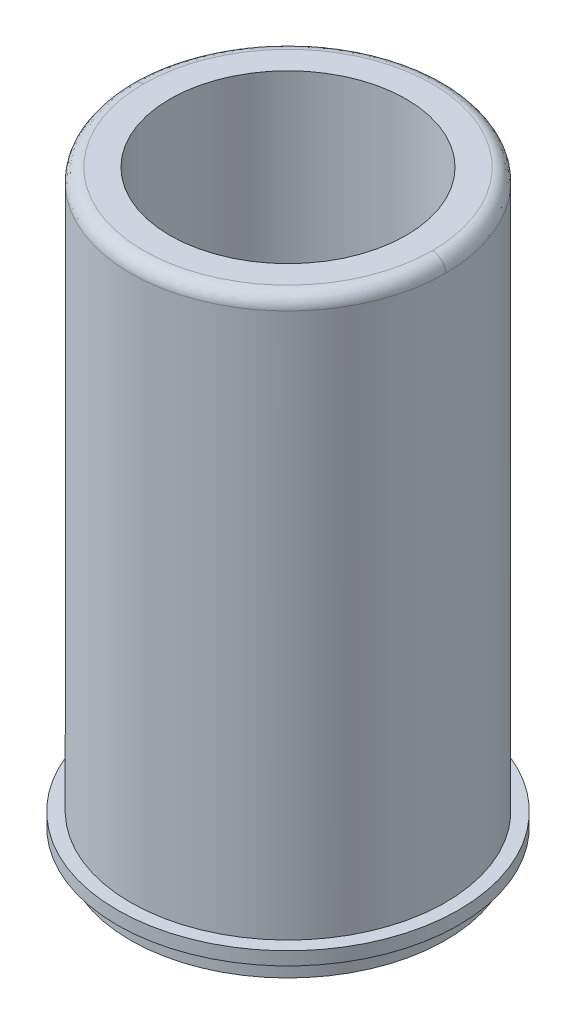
ISO-10303-21;
HEADER;
FILE_DESCRIPTION(('STEP AP214'),'2;1');
FILE_NAME('part.step','',(''),(''),'','','');
FILE_SCHEMA(('AUTOMOTIVE_DESIGN { 1 0 10303 214 1 1 1 1 }'));
ENDSEC;
DATA;
#1=APPLICATION_CONTEXT('core data for automotive mechanical design processes');
#2=APPLICATION_PROTOCOL_DEFINITION('international standard','automotive_design',2000,#1);
#3=PRODUCT_CONTEXT('',#1,'mechanical');
#4=PRODUCT('Part','Part','',(#3));
#5=PRODUCT_RELATED_PRODUCT_CATEGORY('part','',(#4));
#6=PRODUCT_DEFINITION_FORMATION('','',#4);
#7=PRODUCT_DEFINITION_CONTEXT('part definition',#1,'design');
#8=PRODUCT_DEFINITION('design','',#6,#7);
#9=PRODUCT_DEFINITION_SHAPE('','',#8);
#10=(LENGTH_UNIT() NAMED_UNIT(*) SI_UNIT(.MILLI.,.METRE.));
#11=(NAMED_UNIT(*) PLANE_ANGLE_UNIT() SI_UNIT($,.RADIAN.));
#12=(NAMED_UNIT(*) SI_UNIT($,.STERADIAN.) SOLID_ANGLE_UNIT());
#13=UNCERTAINTY_MEASURE_WITH_UNIT(LENGTH_MEASURE(1.E-05),#10,'distance_accuracy_value','');
#14=(GEOMETRIC_REPRESENTATION_CONTEXT(3) GLOBAL_UNCERTAINTY_ASSIGNED_CONTEXT((#13)) GLOBAL_UNIT_ASSIGNED_CONTEXT((#10,
#11,#12)) REPRESENTATION_CONTEXT('',''));
#15=CARTESIAN_POINT('',(0.,0.,0.));
#16=DIRECTION('',(0.,0.,1.));
#17=DIRECTION('',(1.,0.,0.));
#18=AXIS2_PLACEMENT_3D('',#15,#16,#17);
#19=CARTESIAN_POINT('',(-58.156,-130.,158.844));
#20=DIRECTION('',(0.,-1.,0.));
#21=DIRECTION('',(1.,0.,0.));
#22=AXIS2_PLACEMENT_3D('',#19,#20,#21);
#23=PLANE('',#22);
#24=CARTESIAN_POINT('',(-45.,-130.,172.));
#25=DIRECTION('',(0.,1.,0.));
#26=DIRECTION('',(0.,0.,1.));
#27=AXIS2_PLACEMENT_3D('',#24,#25,#26);
#28=CIRCLE('',#27,12.);
#29=CARTESIAN_POINT('',(-45.,-130.,184.));
#30=VERTEX_POINT('',#29);
#31=EDGE_CURVE('E29',#30,#30,#28,.T.);
#32=ORIENTED_EDGE('',*,*,#31,.T.);
#33=EDGE_LOOP('',(#32));
#34=FACE_BOUND('',#33,.T.);
#35=CARTESIAN_POINT('',(-45.,-130.,172.));
#36=DIRECTION('',(0.,-1.,0.));
#37=DIRECTION('',(0.,0.,-1.));
#38=AXIS2_PLACEMENT_3D('',#35,#36,#37);
#39=CIRCLE('',#38,13.);
#40=CARTESIAN_POINT('',(-45.,-130.,159.));
#41=VERTEX_POINT('',#40);
#42=EDGE_CURVE('E112',#41,#41,#39,.T.);
#43=ORIENTED_EDGE('',*,*,#42,.T.);
#44=EDGE_LOOP('',(#43));
#45=FACE_BOUND('',#44,.T.);
#46=ADVANCED_FACE('F24',(#34,#45),#23,.T.);
#47=CARTESIAN_POINT('',(-45.,-131.5,172.));
#48=DIRECTION('',(0.,1.,0.));
#49=DIRECTION('',(0.,0.,1.));
#50=AXIS2_PLACEMENT_3D('',#47,#48,#49);
#51=CYLINDRICAL_SURFACE('',#50,12.);
#52=ORIENTED_EDGE('',*,*,#31,.F.);
#53=EDGE_LOOP('',(#52));
#54=FACE_BOUND('',#53,.T.);
#55=CARTESIAN_POINT('',(-45.,-131.5,172.));
#56=DIRECTION('',(0.,1.,0.));
#57=DIRECTION('',(0.,0.,1.));
#58=AXIS2_PLACEMENT_3D('',#55,#56,#57);
#59=CIRCLE('',#58,12.);
#60=CARTESIAN_POINT('',(-45.,-131.5,184.));
#61=VERTEX_POINT('',#60);
#62=EDGE_CURVE('E69',#61,#61,#59,.F.);
#63=ORIENTED_EDGE('',*,*,#62,.F.);
#64=EDGE_LOOP('',(#63));
#65=FACE_BOUND('',#64,.T.);
#66=ADVANCED_FACE('F120',(#54,#65),#51,.T.);
#67=CARTESIAN_POINT('',(-45.,-129.,172.));
#68=DIRECTION('',(0.,-1.,0.));
#69=DIRECTION('',(0.,0.,-1.));
#70=AXIS2_PLACEMENT_3D('',#67,#68,#69);
#71=CYLINDRICAL_SURFACE('',#70,13.);
#72=ORIENTED_EDGE('',*,*,#42,.F.);
#73=EDGE_LOOP('',(#72));
#74=FACE_BOUND('',#73,.T.);
#75=CARTESIAN_POINT('',(-45.,-129.,172.));
#76=DIRECTION('',(0.,-1.,0.));
#77=DIRECTION('',(0.,0.,-1.));
#78=AXIS2_PLACEMENT_3D('',#75,#76,#77);
#79=CIRCLE('',#78,13.);
#80=CARTESIAN_POINT('',(-45.,-129.,159.));
#81=VERTEX_POINT('',#80);
#82=EDGE_CURVE('E66',#81,#81,#79,.F.);
#83=ORIENTED_EDGE('',*,*,#82,.F.);
#84=EDGE_LOOP('',(#83));
#85=FACE_BOUND('',#84,.T.);
#86=ADVANCED_FACE('F123',(#74,#85),#71,.T.);
#87=CARTESIAN_POINT('',(-57.144,-131.5,159.856));
#88=DIRECTION('',(0.,-1.,0.));
#89=DIRECTION('',(1.,0.,0.));
#90=AXIS2_PLACEMENT_3D('',#87,#88,#89);
#91=PLANE('',#90);
#92=CARTESIAN_POINT('',(-45.,-131.5,172.));
#93=DIRECTION('',(0.,-1.,0.));
#94=DIRECTION('',(0.,0.,-1.));
#95=AXIS2_PLACEMENT_3D('',#92,#93,#94);
#96=CIRCLE('',#95,9.);
#97=CARTESIAN_POINT('',(-45.,-131.5,163.));
#98=VERTEX_POINT('',#97);
#99=EDGE_CURVE('E108',#98,#98,#96,.T.);
#100=ORIENTED_EDGE('',*,*,#99,.F.);
#101=EDGE_LOOP('',(#100));
#102=FACE_BOUND('',#101,.T.);
#103=ORIENTED_EDGE('',*,*,#62,.T.);
#104=EDGE_LOOP('',(#103));
#105=FACE_BOUND('',#104,.T.);
#106=ADVANCED_FACE('F127',(#102,#105),#91,.T.);
#107=CARTESIAN_POINT('',(-58.156,-129.,185.156));
#108=DIRECTION('',(0.,1.,0.));
#109=DIRECTION('',(1.,0.,0.));
#110=AXIS2_PLACEMENT_3D('',#107,#108,#109);
#111=PLANE('',#110);
#112=CARTESIAN_POINT('',(-45.,-129.,172.));
#113=DIRECTION('',(0.,1.,0.));
#114=DIRECTION('',(0.,0.,1.));
#115=AXIS2_PLACEMENT_3D('',#112,#113,#114);
#116=CIRCLE('',#115,12.);
#117=CARTESIAN_POINT('',(-45.,-129.,184.));
#118=VERTEX_POINT('',#117);
#119=EDGE_CURVE('E105',#118,#118,#116,.F.);
#120=ORIENTED_EDGE('',*,*,#119,.T.);
#121=EDGE_LOOP('',(#120));
#122=FACE_BOUND('',#121,.T.);
#123=ORIENTED_EDGE('',*,*,#82,.T.);
#124=EDGE_LOOP('',(#123));
#125=FACE_BOUND('',#124,.T.);
#126=ADVANCED_FACE('F129',(#122,#125),#111,.T.);
#127=CARTESIAN_POINT('',(-55.900166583,-86.504995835,172.));
#128=CARTESIAN_POINT('',(-55.900166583,-86.504995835,193.800333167));
#129=CARTESIAN_POINT('',(-34.099833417,-86.504995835,193.800333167));
#130=CARTESIAN_POINT('',(-34.099833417,-86.504995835,172.));
#131=CARTESIAN_POINT('',(-56.580053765,-86.436779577,172.));
#132=CARTESIAN_POINT('',(-56.580053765,-86.436779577,195.16010753));
#133=CARTESIAN_POINT('',(-33.419946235,-86.436779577,195.16010753));
#134=CARTESIAN_POINT('',(-33.419946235,-86.436779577,172.));
#135=CARTESIAN_POINT('',(-57.063220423,-86.919946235,172.));
#136=CARTESIAN_POINT('',(-57.063220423,-86.919946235,196.126440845));
#137=CARTESIAN_POINT('',(-32.936779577,-86.919946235,196.126440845));
#138=CARTESIAN_POINT('',(-32.936779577,-86.919946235,172.));
#139=CARTESIAN_POINT('',(-56.995004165,-87.599833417,172.));
#140=CARTESIAN_POINT('',(-56.995004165,-87.599833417,195.990008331));
#141=CARTESIAN_POINT('',(-33.004995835,-87.599833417,195.990008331));
#142=CARTESIAN_POINT('',(-33.004995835,-87.599833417,172.));
#143=(BOUNDED_SURFACE() B_SPLINE_SURFACE(3,3,((#127,#128,#129,#130),(#131,#132,#133,#134),(#135,
#136,#137,#138),(#139,#140,#141,#142)),.UNSPECIFIED.,.F.,.F.,
.F.) B_SPLINE_SURFACE_WITH_KNOTS((4,4),(4,4),(0.,1.),(0.,1.),
.UNSPECIFIED.) GEOMETRIC_REPRESENTATION_ITEM() RATIONAL_B_SPLINE_SURFACE(((1.,0.333333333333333,
0.333333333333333,1.),(0.755320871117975,0.251773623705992,0.251773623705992,0.755320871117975),
(0.755320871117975,0.251773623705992,0.251773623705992,0.755320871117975),(1.,0.333333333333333,
0.333333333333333,1.))) REPRESENTATION_ITEM('') SURFACE());
#144=CARTESIAN_POINT('',(-34.099833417,-86.504995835,172.));
#145=CARTESIAN_POINT('',(-33.419946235,-86.436779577,172.));
#146=CARTESIAN_POINT('',(-32.936779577,-86.919946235,172.));
#147=CARTESIAN_POINT('',(-33.004995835,-87.599833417,172.));
#148=(BOUNDED_CURVE() B_SPLINE_CURVE(3,(#144,#145,#146,#147),.UNSPECIFIED.,.F.,
.F.) B_SPLINE_CURVE_WITH_KNOTS((4,4),(0.,1.),
.UNSPECIFIED.) CURVE() GEOMETRIC_REPRESENTATION_ITEM() RATIONAL_B_SPLINE_CURVE((1.,
0.755320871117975,0.755320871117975,1.)) REPRESENTATION_ITEM(''));
#149=CARTESIAN_POINT('',(-33.0000000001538,-87.4999999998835,172.));
#150=VERTEX_POINT('',#149);
#151=CARTESIAN_POINT('',(-34.0000000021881,-86.500000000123,172.));
#152=VERTEX_POINT('',#151);
#153=EDGE_CURVE('E42',#150,#152,#148,.F.);
#154=CARTESIAN_POINT('',(-34.0000000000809,-86.5000000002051,172.));
#155=CARTESIAN_POINT('',(-34.0000000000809,-86.500000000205,194.000000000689));
#156=CARTESIAN_POINT('',(-55.9999999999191,-86.500000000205,194.000000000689));
#157=CARTESIAN_POINT('',(-55.9999999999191,-86.5000000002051,172.));
#158=(BOUNDED_CURVE() B_SPLINE_CURVE(3,(#154,#155,#156,#157),.UNSPECIFIED.,.F.,
.F.) B_SPLINE_CURVE_WITH_KNOTS((4,4),(0.,1.),
.UNSPECIFIED.) CURVE() GEOMETRIC_REPRESENTATION_ITEM() RATIONAL_B_SPLINE_CURVE((0.956578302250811,
0.318859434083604,0.318859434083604,0.956578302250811)) REPRESENTATION_ITEM(''));
#159=CARTESIAN_POINT('',(-55.9999999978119,-86.500000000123,172.));
#160=VERTEX_POINT('',#159);
#161=EDGE_CURVE('E63',#160,#152,#158,.F.);
#162=CARTESIAN_POINT('',(-55.900166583,-86.504995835,172.));
#163=CARTESIAN_POINT('',(-56.580053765,-86.436779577,172.));
#164=CARTESIAN_POINT('',(-57.063220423,-86.919946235,172.));
#165=CARTESIAN_POINT('',(-56.995004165,-87.599833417,172.));
#166=(BOUNDED_CURVE() B_SPLINE_CURVE(3,(#162,#163,#164,#165),.UNSPECIFIED.,.F.,
.F.) B_SPLINE_CURVE_WITH_KNOTS((4,4),(0.,1.),
.UNSPECIFIED.) CURVE() GEOMETRIC_REPRESENTATION_ITEM() RATIONAL_B_SPLINE_CURVE((1.,
0.755320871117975,0.755320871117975,1.)) REPRESENTATION_ITEM(''));
#167=CARTESIAN_POINT('',(-56.9999999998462,-87.4999999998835,172.000000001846));
#168=VERTEX_POINT('',#167);
#169=EDGE_CURVE('E56',#160,#168,#166,.T.);
#170=CARTESIAN_POINT('',(-45.,-87.4999999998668,172.));
#171=DIRECTION('',(0.,1.,0.));
#172=DIRECTION('',(0.,0.,1.));
#173=AXIS2_PLACEMENT_3D('',#170,#171,#172);
#174=CIRCLE('',#173,11.9999999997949);
#175=EDGE_CURVE('E51',#168,#150,#174,.T.);
#176=ORIENTED_EDGE('',*,*,#153,.T.);
#177=ORIENTED_EDGE('',*,*,#161,.F.);
#178=ORIENTED_EDGE('',*,*,#169,.T.);
#179=ORIENTED_EDGE('',*,*,#175,.T.);
#180=EDGE_LOOP('',(#176,#177,#178,#179));
#181=FACE_BOUND('',#180,.T.);
#182=ADVANCED_FACE('F62',(#181),#143,.T.);
#183=CARTESIAN_POINT('',(-45.,-86.5,172.));
#184=DIRECTION('',(0.,-1.,0.));
#185=DIRECTION('',(0.,0.,-1.));
#186=AXIS2_PLACEMENT_3D('',#183,#184,#185);
#187=CYLINDRICAL_SURFACE('',#186,9.);
#188=ORIENTED_EDGE('',*,*,#99,.T.);
#189=EDGE_LOOP('',(#188));
#190=FACE_BOUND('',#189,.T.);
#191=CARTESIAN_POINT('',(-45.,-86.5,172.));
#192=DIRECTION('',(0.,-1.,0.));
#193=DIRECTION('',(0.,0.,-1.));
#194=AXIS2_PLACEMENT_3D('',#191,#192,#193);
#195=CIRCLE('',#194,9.);
#196=CARTESIAN_POINT('',(-45.,-86.5,163.));
#197=VERTEX_POINT('',#196);
#198=EDGE_CURVE('E60',#197,#197,#195,.T.);
#199=ORIENTED_EDGE('',*,*,#198,.F.);
#200=EDGE_LOOP('',(#199));
#201=FACE_BOUND('',#200,.T.);
#202=ADVANCED_FACE('F180',(#190,#201),#187,.F.);
#203=CARTESIAN_POINT('',(-45.,-129.,172.));
#204=DIRECTION('',(0.,1.,0.));
#205=DIRECTION('',(0.,0.,1.));
#206=AXIS2_PLACEMENT_3D('',#203,#204,#205);
#207=CYLINDRICAL_SURFACE('',#206,12.);
#208=CARTESIAN_POINT('',(-45.,-87.4999999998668,172.));
#209=DIRECTION('',(0.,1.,0.));
#210=DIRECTION('',(0.,0.,1.));
#211=AXIS2_PLACEMENT_3D('',#208,#209,#210);
#212=CIRCLE('',#211,11.9999999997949);
#213=EDGE_CURVE('E35',#150,#168,#212,.T.);
#214=ORIENTED_EDGE('',*,*,#213,.F.);
#215=ORIENTED_EDGE('',*,*,#175,.F.);
#216=EDGE_LOOP('',(#214,#215));
#217=FACE_BOUND('',#216,.T.);
#218=ORIENTED_EDGE('',*,*,#119,.F.);
#219=EDGE_LOOP('',(#218));
#220=FACE_BOUND('',#219,.T.);
#221=ADVANCED_FACE('F53',(#217,#220),#207,.T.);
#222=CARTESIAN_POINT('',(-33.868,-86.5,160.868));
#223=DIRECTION('',(0.,1.,0.));
#224=DIRECTION('',(-1.,0.,0.));
#225=AXIS2_PLACEMENT_3D('',#222,#223,#224);
#226=PLANE('',#225);
#227=ORIENTED_EDGE('',*,*,#198,.T.);
#228=EDGE_LOOP('',(#227));
#229=FACE_BOUND('',#228,.T.);
#230=ORIENTED_EDGE('',*,*,#161,.T.);
#231=CARTESIAN_POINT('',(-55.9999999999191,-86.5000000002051,172.));
#232=CARTESIAN_POINT('',(-55.9999999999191,-86.5000000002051,149.999999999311));
#233=CARTESIAN_POINT('',(-34.0000000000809,-86.5000000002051,149.999999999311));
#234=CARTESIAN_POINT('',(-34.0000000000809,-86.5000000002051,172.));
#235=(BOUNDED_CURVE() B_SPLINE_CURVE(3,(#231,#232,#233,#234),.UNSPECIFIED.,.F.,
.F.) B_SPLINE_CURVE_WITH_KNOTS((4,4),(0.,1.),
.UNSPECIFIED.) CURVE() GEOMETRIC_REPRESENTATION_ITEM() RATIONAL_B_SPLINE_CURVE((0.956578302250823,
0.318859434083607,0.318859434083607,0.956578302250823)) REPRESENTATION_ITEM(''));
#236=EDGE_CURVE('E13',#160,#152,#235,.T.);
#237=ORIENTED_EDGE('',*,*,#236,.F.);
#238=EDGE_LOOP('',(#230,#237));
#239=FACE_BOUND('',#238,.T.);
#240=ADVANCED_FACE('F26',(#229,#239),#226,.T.);
#241=CARTESIAN_POINT('',(-34.099833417,-86.504995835,172.));
#242=CARTESIAN_POINT('',(-34.099833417,-86.504995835,150.199666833));
#243=CARTESIAN_POINT('',(-55.900166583,-86.504995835,150.199666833));
#244=CARTESIAN_POINT('',(-55.900166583,-86.504995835,172.));
#245=CARTESIAN_POINT('',(-33.419946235,-86.436779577,172.));
#246=CARTESIAN_POINT('',(-33.419946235,-86.436779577,148.83989247));
#247=CARTESIAN_POINT('',(-56.580053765,-86.436779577,148.83989247));
#248=CARTESIAN_POINT('',(-56.580053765,-86.436779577,172.));
#249=CARTESIAN_POINT('',(-32.936779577,-86.919946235,172.));
#250=CARTESIAN_POINT('',(-32.936779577,-86.919946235,147.873559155));
#251=CARTESIAN_POINT('',(-57.063220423,-86.919946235,147.873559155));
#252=CARTESIAN_POINT('',(-57.063220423,-86.919946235,172.));
#253=CARTESIAN_POINT('',(-33.004995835,-87.599833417,172.));
#254=CARTESIAN_POINT('',(-33.004995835,-87.599833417,148.009991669));
#255=CARTESIAN_POINT('',(-56.995004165,-87.599833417,148.009991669));
#256=CARTESIAN_POINT('',(-56.995004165,-87.599833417,172.));
#257=(BOUNDED_SURFACE() B_SPLINE_SURFACE(3,3,((#241,#242,#243,#244),(#245,#246,#247,#248),(#249,
#250,#251,#252),(#253,#254,#255,#256)),.UNSPECIFIED.,.F.,.F.,
.F.) B_SPLINE_SURFACE_WITH_KNOTS((4,4),(4,4),(0.,1.),(0.,1.),
.UNSPECIFIED.) GEOMETRIC_REPRESENTATION_ITEM() RATIONAL_B_SPLINE_SURFACE(((1.,0.333333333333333,
0.333333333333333,1.),(0.755320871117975,0.251773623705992,0.251773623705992,0.755320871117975),
(0.755320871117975,0.251773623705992,0.251773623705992,0.755320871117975),(1.,0.333333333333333,
0.333333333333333,1.))) REPRESENTATION_ITEM('') SURFACE());
#258=ORIENTED_EDGE('',*,*,#236,.T.);
#259=ORIENTED_EDGE('',*,*,#153,.F.);
#260=ORIENTED_EDGE('',*,*,#213,.T.);
#261=ORIENTED_EDGE('',*,*,#169,.F.);
#262=EDGE_LOOP('',(#258,#259,#260,#261));
#263=FACE_BOUND('',#262,.T.);
#264=ADVANCED_FACE('F59',(#263),#257,.T.);
#265=CLOSED_SHELL('',(#46,#66,#86,#106,#126,#182,#202,#221,#240,#264));
#266=MANIFOLD_SOLID_BREP('B1',#265);
#267=ADVANCED_BREP_SHAPE_REPRESENTATION('',(#18,#266),#14);
#268=SHAPE_DEFINITION_REPRESENTATION(#9,#267);
ENDSEC;
END-ISO-10303-21;
